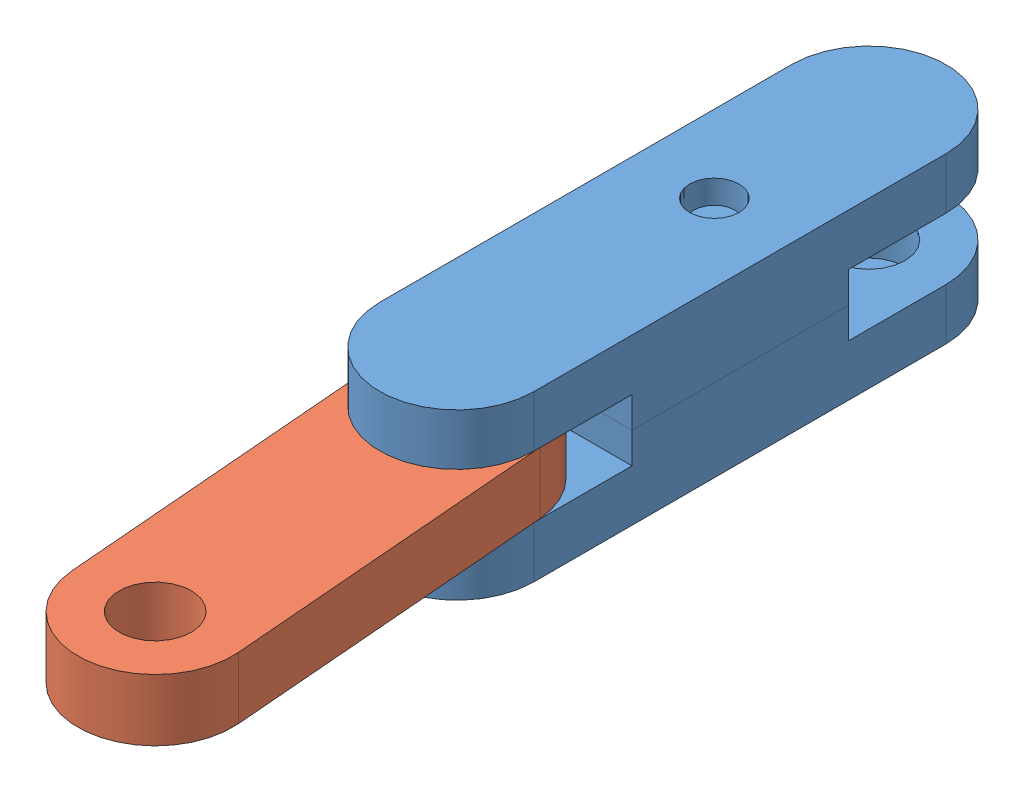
SolidWorks assembly Assem2.sldasm, configuration Default (file format 8000). Lengths in mm.
Overall size (9.39 8 43.74).
3 component instances, 2 part files, 5 mates.
Components (placement in the parent):
- 3.5.3 Base-1: 3.5.3 Base.SLDPRT [Default] at origin size (7.5 7 27.5)
- 3.5.3 Rod-1: 3.5.3 Rod.SLDPRT [Default] at (0.6509 2.5 27.9735) x (0.996684 0 -0.081365) z (0.081365 0 0.996684) size (7.5 3 23.5)
- 3.5.3 Base-2: 3.5.3 Base.SLDPRT [Default] at (0 8 20) x (1 0 0) z (0 0 -1) size (7.5 7 27.5)
Mates (geometry in assembly coordinates):
- Coincident6: coincident anti-aligned: plane of 3.5.3 Base-1 through (0 4 0) normal (0 1 0); plane of 3.5.3 Base-2 through (0 4 20) normal (0 -1 0)
- Concentric1: concentric aligned: cylinder of 3.5.3 Base-1 through (0 7 7.5) axis (0 -1 0) radius 1; cylinder of 3.5.3 Base-2 through (0 8 7.5) axis (0 -1 0) radius 1.2
- Coincident7: coincident aligned: plane of 3.5.3 Base-1 through (-3.75 4 0) normal (-1 0 0); plane of 3.5.3 Base-2 through (-3.75 4 20) normal (-1 0 0)
- Coincident8: coincident anti-aligned: plane of 3.5.3 Rod-1 through (0 5.5 20) normal (0 1 0); plane of 3.5.3 Base-2 through (0 5.5 20) normal (0 -1 0)
- Coincident9: coincident anti-aligned: axis of 3.5.3 Rod-1 through (0 5.5 20) axis (0 -1 0); axis of 3.5.3 Base-2 through (0 5.5 20) axis (0 1 0)
